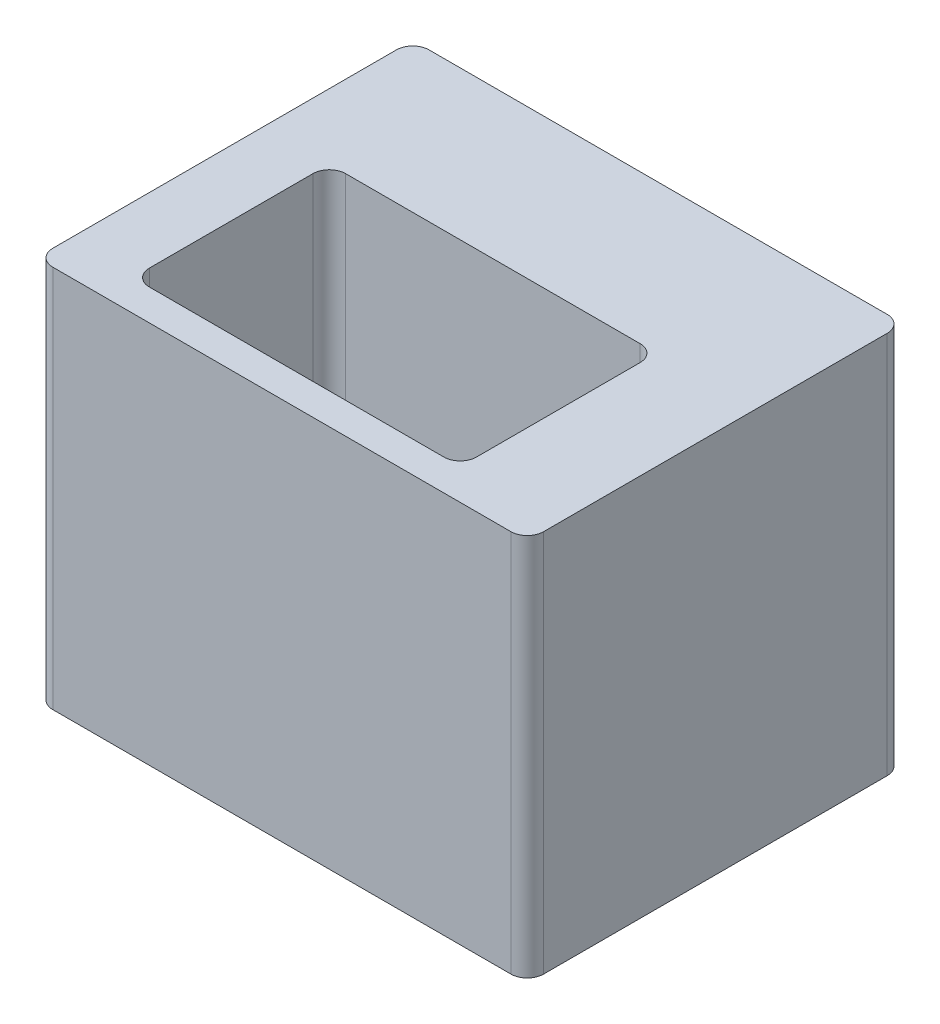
ISO-10303-21;
HEADER;
FILE_DESCRIPTION(('STEP AP214'),'2;1');
FILE_NAME('part.step','',(''),(''),'','','');
FILE_SCHEMA(('AUTOMOTIVE_DESIGN { 1 0 10303 214 1 1 1 1 }'));
ENDSEC;
DATA;
#1=APPLICATION_CONTEXT('core data for automotive mechanical design processes');
#2=APPLICATION_PROTOCOL_DEFINITION('international standard','automotive_design',2000,#1);
#3=PRODUCT_CONTEXT('',#1,'mechanical');
#4=PRODUCT('Part','Part','',(#3));
#5=PRODUCT_RELATED_PRODUCT_CATEGORY('part','',(#4));
#6=PRODUCT_DEFINITION_FORMATION('','',#4);
#7=PRODUCT_DEFINITION_CONTEXT('part definition',#1,'design');
#8=PRODUCT_DEFINITION('design','',#6,#7);
#9=PRODUCT_DEFINITION_SHAPE('','',#8);
#10=(LENGTH_UNIT() NAMED_UNIT(*) SI_UNIT(.MILLI.,.METRE.));
#11=(NAMED_UNIT(*) PLANE_ANGLE_UNIT() SI_UNIT($,.RADIAN.));
#12=(NAMED_UNIT(*) SI_UNIT($,.STERADIAN.) SOLID_ANGLE_UNIT());
#13=UNCERTAINTY_MEASURE_WITH_UNIT(LENGTH_MEASURE(1.E-05),#10,'distance_accuracy_value','');
#14=(GEOMETRIC_REPRESENTATION_CONTEXT(3) GLOBAL_UNCERTAINTY_ASSIGNED_CONTEXT((#13)) GLOBAL_UNIT_ASSIGNED_CONTEXT((#10,
#11,#12)) REPRESENTATION_CONTEXT('',''));
#15=CARTESIAN_POINT('',(0.,0.,0.));
#16=DIRECTION('',(0.,0.,1.));
#17=DIRECTION('',(1.,0.,0.));
#18=AXIS2_PLACEMENT_3D('',#15,#16,#17);
#19=CARTESIAN_POINT('',(-19.05,29.7434,-14.605));
#20=DIRECTION('',(1.,0.,0.));
#21=DIRECTION('',(0.,0.,-1.));
#22=AXIS2_PLACEMENT_3D('',#19,#20,#21);
#23=PLANE('',#22);
#24=DIRECTION('',(0.,0.,1.));
#25=VECTOR('',#24,1.);
#26=CARTESIAN_POINT('',(-19.05,29.7434,-14.605));
#27=LINE('',#26,#25);
#28=CARTESIAN_POINT('',(-19.05,29.7434,-13.335));
#29=VERTEX_POINT('',#28);
#30=CARTESIAN_POINT('',(-19.05,29.7434,13.335));
#31=VERTEX_POINT('',#30);
#32=EDGE_CURVE('E166',#29,#31,#27,.T.);
#33=ORIENTED_EDGE('',*,*,#32,.F.);
#34=DIRECTION('',(0.,-1.,0.));
#35=VECTOR('',#34,1.);
#36=CARTESIAN_POINT('',(-19.05,29.7434,-13.335));
#37=LINE('',#36,#35);
#38=CARTESIAN_POINT('',(-19.05,0.,-13.335));
#39=VERTEX_POINT('',#38);
#40=EDGE_CURVE('E151',#29,#39,#37,.T.);
#41=ORIENTED_EDGE('',*,*,#40,.T.);
#42=DIRECTION('',(0.,0.,1.));
#43=VECTOR('',#42,1.);
#44=CARTESIAN_POINT('',(-19.05,0.,-14.605));
#45=LINE('',#44,#43);
#46=CARTESIAN_POINT('',(-19.05,0.,13.335));
#47=VERTEX_POINT('',#46);
#48=EDGE_CURVE('E163',#39,#47,#45,.T.);
#49=ORIENTED_EDGE('',*,*,#48,.T.);
#50=DIRECTION('',(0.,-1.,0.));
#51=VECTOR('',#50,1.);
#52=CARTESIAN_POINT('',(-19.05,29.7434,13.335));
#53=LINE('',#52,#51);
#54=EDGE_CURVE('E168',#47,#31,#53,.F.);
#55=ORIENTED_EDGE('',*,*,#54,.T.);
#56=EDGE_LOOP('',(#33,#41,#49,#55));
#57=FACE_BOUND('',#56,.T.);
#58=ADVANCED_FACE('F33',(#57),#23,.F.);
#59=CARTESIAN_POINT('',(-19.05,29.7434,14.605));
#60=DIRECTION('',(0.,0.,-1.));
#61=DIRECTION('',(-1.,0.,0.));
#62=AXIS2_PLACEMENT_3D('',#59,#60,#61);
#63=PLANE('',#62);
#64=DIRECTION('',(1.,0.,0.));
#65=VECTOR('',#64,1.);
#66=CARTESIAN_POINT('',(-19.05,0.,14.605));
#67=LINE('',#66,#65);
#68=CARTESIAN_POINT('',(-17.78,0.,14.605));
#69=VERTEX_POINT('',#68);
#70=CARTESIAN_POINT('',(17.78,0.,14.605));
#71=VERTEX_POINT('',#70);
#72=EDGE_CURVE('E172',#69,#71,#67,.T.);
#73=ORIENTED_EDGE('',*,*,#72,.T.);
#74=DIRECTION('',(0.,-1.,0.));
#75=VECTOR('',#74,1.);
#76=CARTESIAN_POINT('',(17.78,29.7434,14.605));
#77=LINE('',#76,#75);
#78=CARTESIAN_POINT('',(17.78,29.7434,14.605));
#79=VERTEX_POINT('',#78);
#80=EDGE_CURVE('E212',#71,#79,#77,.F.);
#81=ORIENTED_EDGE('',*,*,#80,.T.);
#82=DIRECTION('',(1.,0.,0.));
#83=VECTOR('',#82,1.);
#84=CARTESIAN_POINT('',(-19.05,29.7434,14.605));
#85=LINE('',#84,#83);
#86=CARTESIAN_POINT('',(-17.78,29.7434,14.605));
#87=VERTEX_POINT('',#86);
#88=EDGE_CURVE('E284',#87,#79,#85,.T.);
#89=ORIENTED_EDGE('',*,*,#88,.F.);
#90=DIRECTION('',(0.,-1.,0.));
#91=VECTOR('',#90,1.);
#92=CARTESIAN_POINT('',(-17.78,29.7434,14.605));
#93=LINE('',#92,#91);
#94=EDGE_CURVE('E209',#87,#69,#93,.T.);
#95=ORIENTED_EDGE('',*,*,#94,.T.);
#96=EDGE_LOOP('',(#73,#81,#89,#95));
#97=FACE_BOUND('',#96,.T.);
#98=ADVANCED_FACE('F307',(#97),#63,.F.);
#99=CARTESIAN_POINT('',(19.05,29.7434,-14.605));
#100=DIRECTION('',(-1.,0.,0.));
#101=DIRECTION('',(0.,0.,1.));
#102=AXIS2_PLACEMENT_3D('',#99,#100,#101);
#103=PLANE('',#102);
#104=DIRECTION('',(0.,0.,-1.));
#105=VECTOR('',#104,1.);
#106=CARTESIAN_POINT('',(19.05,0.,-14.605));
#107=LINE('',#106,#105);
#108=CARTESIAN_POINT('',(19.05,0.,13.335));
#109=VERTEX_POINT('',#108);
#110=CARTESIAN_POINT('',(19.05,0.,-13.335));
#111=VERTEX_POINT('',#110);
#112=EDGE_CURVE('E176',#109,#111,#107,.T.);
#113=ORIENTED_EDGE('',*,*,#112,.T.);
#114=DIRECTION('',(0.,-1.,0.));
#115=VECTOR('',#114,1.);
#116=CARTESIAN_POINT('',(19.05,29.7434,-13.335));
#117=LINE('',#116,#115);
#118=CARTESIAN_POINT('',(19.05,29.7434,-13.335));
#119=VERTEX_POINT('',#118);
#120=EDGE_CURVE('E207',#111,#119,#117,.F.);
#121=ORIENTED_EDGE('',*,*,#120,.T.);
#122=DIRECTION('',(0.,0.,-1.));
#123=VECTOR('',#122,1.);
#124=CARTESIAN_POINT('',(19.05,29.7434,-14.605));
#125=LINE('',#124,#123);
#126=CARTESIAN_POINT('',(19.05,29.7434,13.335));
#127=VERTEX_POINT('',#126);
#128=EDGE_CURVE('E286',#127,#119,#125,.T.);
#129=ORIENTED_EDGE('',*,*,#128,.F.);
#130=DIRECTION('',(0.,-1.,0.));
#131=VECTOR('',#130,1.);
#132=CARTESIAN_POINT('',(19.05,29.7434,13.335));
#133=LINE('',#132,#131);
#134=EDGE_CURVE('E204',#127,#109,#133,.T.);
#135=ORIENTED_EDGE('',*,*,#134,.T.);
#136=EDGE_LOOP('',(#113,#121,#129,#135));
#137=FACE_BOUND('',#136,.T.);
#138=ADVANCED_FACE('F300',(#137),#103,.F.);
#139=CARTESIAN_POINT('',(-19.05,29.7434,-14.605));
#140=DIRECTION('',(0.,0.,1.));
#141=DIRECTION('',(1.,0.,0.));
#142=AXIS2_PLACEMENT_3D('',#139,#140,#141);
#143=PLANE('',#142);
#144=DIRECTION('',(-1.,0.,0.));
#145=VECTOR('',#144,1.);
#146=CARTESIAN_POINT('',(-19.05,0.,-14.605));
#147=LINE('',#146,#145);
#148=CARTESIAN_POINT('',(17.78,0.,-14.605));
#149=VERTEX_POINT('',#148);
#150=CARTESIAN_POINT('',(-17.78,0.,-14.605));
#151=VERTEX_POINT('',#150);
#152=EDGE_CURVE('E186',#149,#151,#147,.T.);
#153=ORIENTED_EDGE('',*,*,#152,.T.);
#154=DIRECTION('',(0.,-1.,0.));
#155=VECTOR('',#154,1.);
#156=CARTESIAN_POINT('',(-17.78,29.7434,-14.605));
#157=LINE('',#156,#155);
#158=CARTESIAN_POINT('',(-17.78,29.7434,-14.605));
#159=VERTEX_POINT('',#158);
#160=EDGE_CURVE('E152',#151,#159,#157,.F.);
#161=ORIENTED_EDGE('',*,*,#160,.T.);
#162=DIRECTION('',(-1.,0.,0.));
#163=VECTOR('',#162,1.);
#164=CARTESIAN_POINT('',(-19.05,29.7434,-14.605));
#165=LINE('',#164,#163);
#166=CARTESIAN_POINT('',(17.78,29.7434,-14.605));
#167=VERTEX_POINT('',#166);
#168=EDGE_CURVE('E181',#167,#159,#165,.T.);
#169=ORIENTED_EDGE('',*,*,#168,.F.);
#170=DIRECTION('',(0.,-1.,0.));
#171=VECTOR('',#170,1.);
#172=CARTESIAN_POINT('',(17.78,29.7434,-14.605));
#173=LINE('',#172,#171);
#174=EDGE_CURVE('E157',#167,#149,#173,.T.);
#175=ORIENTED_EDGE('',*,*,#174,.T.);
#176=EDGE_LOOP('',(#153,#161,#169,#175));
#177=FACE_BOUND('',#176,.T.);
#178=ADVANCED_FACE('F294',(#177),#143,.F.);
#179=CARTESIAN_POINT('',(0.,29.7434,0.));
#180=DIRECTION('',(0.,1.,0.));
#181=DIRECTION('',(0.,0.,1.));
#182=AXIS2_PLACEMENT_3D('',#179,#180,#181);
#183=PLANE('',#182);
#184=DIRECTION('',(0.,0.,1.));
#185=VECTOR('',#184,1.);
#186=CARTESIAN_POINT('',(-13.97,29.7434,-3.048));
#187=LINE('',#186,#185);
#188=CARTESIAN_POINT('',(-13.97,29.7434,-1.778));
#189=VERTEX_POINT('',#188);
#190=CARTESIAN_POINT('',(-13.97,29.7434,10.922));
#191=VERTEX_POINT('',#190);
#192=EDGE_CURVE('E273',#189,#191,#187,.T.);
#193=ORIENTED_EDGE('',*,*,#192,.F.);
#194=CARTESIAN_POINT('',(-12.7,29.7434,-1.778));
#195=DIRECTION('',(0.,1.,0.));
#196=DIRECTION('',(0.,0.,1.));
#197=AXIS2_PLACEMENT_3D('',#194,#195,#196);
#198=CIRCLE('',#197,1.27);
#199=CARTESIAN_POINT('',(-12.7,29.7434,-3.048));
#200=VERTEX_POINT('',#199);
#201=EDGE_CURVE('E11',#189,#200,#198,.F.);
#202=ORIENTED_EDGE('',*,*,#201,.T.);
#203=DIRECTION('',(-1.,0.,0.));
#204=VECTOR('',#203,1.);
#205=CARTESIAN_POINT('',(-13.97,29.7434,-3.048));
#206=LINE('',#205,#204);
#207=CARTESIAN_POINT('',(10.16,29.7434,-3.048));
#208=VERTEX_POINT('',#207);
#209=EDGE_CURVE('E251',#208,#200,#206,.T.);
#210=ORIENTED_EDGE('',*,*,#209,.F.);
#211=CARTESIAN_POINT('',(10.16,29.7434,-1.778));
#212=DIRECTION('',(0.,1.,0.));
#213=DIRECTION('',(0.,0.,1.));
#214=AXIS2_PLACEMENT_3D('',#211,#212,#213);
#215=CIRCLE('',#214,1.27);
#216=CARTESIAN_POINT('',(11.43,29.7434,-1.778));
#217=VERTEX_POINT('',#216);
#218=EDGE_CURVE('E41',#208,#217,#215,.F.);
#219=ORIENTED_EDGE('',*,*,#218,.T.);
#220=DIRECTION('',(0.,0.,-1.));
#221=VECTOR('',#220,1.);
#222=CARTESIAN_POINT('',(11.43,29.7434,-3.048));
#223=LINE('',#222,#221);
#224=CARTESIAN_POINT('',(11.43,29.7434,10.922));
#225=VERTEX_POINT('',#224);
#226=EDGE_CURVE('E250',#225,#217,#223,.T.);
#227=ORIENTED_EDGE('',*,*,#226,.F.);
#228=CARTESIAN_POINT('',(10.16,29.7434,10.922));
#229=DIRECTION('',(0.,1.,0.));
#230=DIRECTION('',(0.,0.,1.));
#231=AXIS2_PLACEMENT_3D('',#228,#229,#230);
#232=CIRCLE('',#231,1.27);
#233=CARTESIAN_POINT('',(10.16,29.7434,12.192));
#234=VERTEX_POINT('',#233);
#235=EDGE_CURVE('E240',#225,#234,#232,.F.);
#236=ORIENTED_EDGE('',*,*,#235,.T.);
#237=DIRECTION('',(1.,0.,0.));
#238=VECTOR('',#237,1.);
#239=CARTESIAN_POINT('',(-13.97,29.7434,12.192));
#240=LINE('',#239,#238);
#241=CARTESIAN_POINT('',(-12.7,29.7434,12.192));
#242=VERTEX_POINT('',#241);
#243=EDGE_CURVE('E259',#242,#234,#240,.T.);
#244=ORIENTED_EDGE('',*,*,#243,.F.);
#245=CARTESIAN_POINT('',(-12.7,29.7434,10.922));
#246=DIRECTION('',(0.,1.,0.));
#247=DIRECTION('',(0.,0.,1.));
#248=AXIS2_PLACEMENT_3D('',#245,#246,#247);
#249=CIRCLE('',#248,1.27);
#250=EDGE_CURVE('E242',#242,#191,#249,.F.);
#251=ORIENTED_EDGE('',*,*,#250,.T.);
#252=EDGE_LOOP('',(#193,#202,#210,#219,#227,#236,#244,#251));
#253=FACE_BOUND('',#252,.T.);
#254=ORIENTED_EDGE('',*,*,#168,.T.);
#255=CARTESIAN_POINT('',(-17.78,29.7434,-13.335));
#256=DIRECTION('',(0.,1.,0.));
#257=DIRECTION('',(0.,0.,1.));
#258=AXIS2_PLACEMENT_3D('',#255,#256,#257);
#259=CIRCLE('',#258,1.27);
#260=EDGE_CURVE('E202',#159,#29,#259,.T.);
#261=ORIENTED_EDGE('',*,*,#260,.T.);
#262=ORIENTED_EDGE('',*,*,#32,.T.);
#263=CARTESIAN_POINT('',(-17.78,29.7434,13.335));
#264=DIRECTION('',(0.,1.,0.));
#265=DIRECTION('',(0.,0.,1.));
#266=AXIS2_PLACEMENT_3D('',#263,#264,#265);
#267=CIRCLE('',#266,1.27);
#268=EDGE_CURVE('E196',#31,#87,#267,.T.);
#269=ORIENTED_EDGE('',*,*,#268,.T.);
#270=ORIENTED_EDGE('',*,*,#88,.T.);
#271=CARTESIAN_POINT('',(17.78,29.7434,13.335));
#272=DIRECTION('',(0.,1.,0.));
#273=DIRECTION('',(0.,0.,1.));
#274=AXIS2_PLACEMENT_3D('',#271,#272,#273);
#275=CIRCLE('',#274,1.27);
#276=EDGE_CURVE('E198',#79,#127,#275,.T.);
#277=ORIENTED_EDGE('',*,*,#276,.T.);
#278=ORIENTED_EDGE('',*,*,#128,.T.);
#279=CARTESIAN_POINT('',(17.78,29.7434,-13.335));
#280=DIRECTION('',(0.,1.,0.));
#281=DIRECTION('',(0.,0.,1.));
#282=AXIS2_PLACEMENT_3D('',#279,#280,#281);
#283=CIRCLE('',#282,1.27);
#284=EDGE_CURVE('E200',#119,#167,#283,.T.);
#285=ORIENTED_EDGE('',*,*,#284,.T.);
#286=EDGE_LOOP('',(#254,#261,#262,#269,#270,#277,#278,#285));
#287=FACE_BOUND('',#286,.T.);
#288=ADVANCED_FACE('F248',(#253,#287),#183,.T.);
#289=CARTESIAN_POINT('',(0.,0.,0.));
#290=DIRECTION('',(0.,1.,0.));
#291=DIRECTION('',(0.,0.,1.));
#292=AXIS2_PLACEMENT_3D('',#289,#290,#291);
#293=PLANE('',#292);
#294=ORIENTED_EDGE('',*,*,#48,.F.);
#295=CARTESIAN_POINT('',(-17.78,0.,-13.335));
#296=DIRECTION('',(0.,1.,0.));
#297=DIRECTION('',(0.,0.,1.));
#298=AXIS2_PLACEMENT_3D('',#295,#296,#297);
#299=CIRCLE('',#298,1.27);
#300=EDGE_CURVE('E147',#39,#151,#299,.F.);
#301=ORIENTED_EDGE('',*,*,#300,.T.);
#302=ORIENTED_EDGE('',*,*,#152,.F.);
#303=CARTESIAN_POINT('',(17.78,0.,-13.335));
#304=DIRECTION('',(0.,1.,0.));
#305=DIRECTION('',(0.,0.,1.));
#306=AXIS2_PLACEMENT_3D('',#303,#304,#305);
#307=CIRCLE('',#306,1.27);
#308=EDGE_CURVE('E158',#149,#111,#307,.F.);
#309=ORIENTED_EDGE('',*,*,#308,.T.);
#310=ORIENTED_EDGE('',*,*,#112,.F.);
#311=CARTESIAN_POINT('',(17.78,0.,13.335));
#312=DIRECTION('',(0.,1.,0.));
#313=DIRECTION('',(0.,0.,1.));
#314=AXIS2_PLACEMENT_3D('',#311,#312,#313);
#315=CIRCLE('',#314,1.27);
#316=EDGE_CURVE('E190',#109,#71,#315,.F.);
#317=ORIENTED_EDGE('',*,*,#316,.T.);
#318=ORIENTED_EDGE('',*,*,#72,.F.);
#319=CARTESIAN_POINT('',(-17.78,0.,13.335));
#320=DIRECTION('',(0.,1.,0.));
#321=DIRECTION('',(0.,0.,1.));
#322=AXIS2_PLACEMENT_3D('',#319,#320,#321);
#323=CIRCLE('',#322,1.27);
#324=EDGE_CURVE('E167',#69,#47,#323,.F.);
#325=ORIENTED_EDGE('',*,*,#324,.T.);
#326=EDGE_LOOP('',(#294,#301,#302,#309,#310,#317,#318,#325));
#327=FACE_BOUND('',#326,.T.);
#328=ADVANCED_FACE('F170',(#327),#293,.F.);
#329=CARTESIAN_POINT('',(-13.97,13.5382,-3.048));
#330=DIRECTION('',(-1.,0.,0.));
#331=DIRECTION('',(0.,0.,1.));
#332=AXIS2_PLACEMENT_3D('',#329,#330,#331);
#333=PLANE('',#332);
#334=ORIENTED_EDGE('',*,*,#192,.T.);
#335=DIRECTION('',(0.,1.,0.));
#336=VECTOR('',#335,1.);
#337=CARTESIAN_POINT('',(-13.97,13.5382,10.922));
#338=LINE('',#337,#336);
#339=CARTESIAN_POINT('',(-13.97,13.5382,10.922));
#340=VERTEX_POINT('',#339);
#341=EDGE_CURVE('E234',#191,#340,#338,.F.);
#342=ORIENTED_EDGE('',*,*,#341,.T.);
#343=DIRECTION('',(0.,0.,1.));
#344=VECTOR('',#343,1.);
#345=CARTESIAN_POINT('',(-13.97,13.5382,-3.048));
#346=LINE('',#345,#344);
#347=CARTESIAN_POINT('',(-13.97,13.5382,-1.778));
#348=VERTEX_POINT('',#347);
#349=EDGE_CURVE('E275',#348,#340,#346,.T.);
#350=ORIENTED_EDGE('',*,*,#349,.F.);
#351=DIRECTION('',(0.,1.,0.));
#352=VECTOR('',#351,1.);
#353=CARTESIAN_POINT('',(-13.97,29.7434,-1.778));
#354=LINE('',#353,#352);
#355=EDGE_CURVE('E231',#348,#189,#354,.T.);
#356=ORIENTED_EDGE('',*,*,#355,.T.);
#357=EDGE_LOOP('',(#334,#342,#350,#356));
#358=FACE_BOUND('',#357,.T.);
#359=ADVANCED_FACE('F272',(#358),#333,.F.);
#360=CARTESIAN_POINT('',(-13.97,13.5382,-3.048));
#361=DIRECTION('',(0.,0.,-1.));
#362=DIRECTION('',(-1.,0.,0.));
#363=AXIS2_PLACEMENT_3D('',#360,#361,#362);
#364=PLANE('',#363);
#365=DIRECTION('',(-1.,0.,0.));
#366=VECTOR('',#365,1.);
#367=CARTESIAN_POINT('',(-13.97,13.5382,-3.048));
#368=LINE('',#367,#366);
#369=CARTESIAN_POINT('',(10.16,13.5382,-3.048));
#370=VERTEX_POINT('',#369);
#371=CARTESIAN_POINT('',(-12.7,13.5382,-3.048));
#372=VERTEX_POINT('',#371);
#373=EDGE_CURVE('E173',#370,#372,#368,.T.);
#374=ORIENTED_EDGE('',*,*,#373,.F.);
#375=DIRECTION('',(0.,1.,0.));
#376=VECTOR('',#375,1.);
#377=CARTESIAN_POINT('',(10.16,29.7434,-3.048));
#378=LINE('',#377,#376);
#379=EDGE_CURVE('E237',#370,#208,#378,.T.);
#380=ORIENTED_EDGE('',*,*,#379,.T.);
#381=ORIENTED_EDGE('',*,*,#209,.T.);
#382=DIRECTION('',(0.,1.,0.));
#383=VECTOR('',#382,1.);
#384=CARTESIAN_POINT('',(-12.7,13.5382,-3.048));
#385=LINE('',#384,#383);
#386=EDGE_CURVE('E48',#200,#372,#385,.F.);
#387=ORIENTED_EDGE('',*,*,#386,.T.);
#388=EDGE_LOOP('',(#374,#380,#381,#387));
#389=FACE_BOUND('',#388,.T.);
#390=ADVANCED_FACE('F262',(#389),#364,.F.);
#391=CARTESIAN_POINT('',(11.43,13.5382,-3.048));
#392=DIRECTION('',(1.,0.,0.));
#393=DIRECTION('',(0.,0.,-1.));
#394=AXIS2_PLACEMENT_3D('',#391,#392,#393);
#395=PLANE('',#394);
#396=DIRECTION('',(0.,0.,-1.));
#397=VECTOR('',#396,1.);
#398=CARTESIAN_POINT('',(11.43,13.5382,-3.048));
#399=LINE('',#398,#397);
#400=CARTESIAN_POINT('',(11.43,13.5382,10.922));
#401=VERTEX_POINT('',#400);
#402=CARTESIAN_POINT('',(11.43,13.5382,-1.778));
#403=VERTEX_POINT('',#402);
#404=EDGE_CURVE('E178',#401,#403,#399,.T.);
#405=ORIENTED_EDGE('',*,*,#404,.F.);
#406=DIRECTION('',(0.,1.,0.));
#407=VECTOR('',#406,1.);
#408=CARTESIAN_POINT('',(11.43,29.7434,10.922));
#409=LINE('',#408,#407);
#410=EDGE_CURVE('E216',#401,#225,#409,.T.);
#411=ORIENTED_EDGE('',*,*,#410,.T.);
#412=ORIENTED_EDGE('',*,*,#226,.T.);
#413=DIRECTION('',(0.,1.,0.));
#414=VECTOR('',#413,1.);
#415=CARTESIAN_POINT('',(11.43,13.5382,-1.778));
#416=LINE('',#415,#414);
#417=EDGE_CURVE('E214',#217,#403,#416,.F.);
#418=ORIENTED_EDGE('',*,*,#417,.T.);
#419=EDGE_LOOP('',(#405,#411,#412,#418));
#420=FACE_BOUND('',#419,.T.);
#421=ADVANCED_FACE('F257',(#420),#395,.F.);
#422=CARTESIAN_POINT('',(-13.97,13.5382,12.192));
#423=DIRECTION('',(0.,0.,1.));
#424=DIRECTION('',(1.,0.,0.));
#425=AXIS2_PLACEMENT_3D('',#422,#423,#424);
#426=PLANE('',#425);
#427=ORIENTED_EDGE('',*,*,#243,.T.);
#428=DIRECTION('',(0.,1.,0.));
#429=VECTOR('',#428,1.);
#430=CARTESIAN_POINT('',(10.16,13.5382,12.192));
#431=LINE('',#430,#429);
#432=CARTESIAN_POINT('',(10.16,13.5382,12.192));
#433=VERTEX_POINT('',#432);
#434=EDGE_CURVE('E222',#234,#433,#431,.F.);
#435=ORIENTED_EDGE('',*,*,#434,.T.);
#436=DIRECTION('',(1.,0.,0.));
#437=VECTOR('',#436,1.);
#438=CARTESIAN_POINT('',(-13.97,13.5382,12.192));
#439=LINE('',#438,#437);
#440=CARTESIAN_POINT('',(-12.7,13.5382,12.192));
#441=VERTEX_POINT('',#440);
#442=EDGE_CURVE('E384',#441,#433,#439,.T.);
#443=ORIENTED_EDGE('',*,*,#442,.F.);
#444=DIRECTION('',(0.,1.,0.));
#445=VECTOR('',#444,1.);
#446=CARTESIAN_POINT('',(-12.7,29.7434,12.192));
#447=LINE('',#446,#445);
#448=EDGE_CURVE('E219',#441,#242,#447,.T.);
#449=ORIENTED_EDGE('',*,*,#448,.T.);
#450=EDGE_LOOP('',(#427,#435,#443,#449));
#451=FACE_BOUND('',#450,.T.);
#452=ADVANCED_FACE('F387',(#451),#426,.F.);
#453=CARTESIAN_POINT('',(0.,13.5382,0.));
#454=DIRECTION('',(0.,1.,0.));
#455=DIRECTION('',(0.,0.,1.));
#456=AXIS2_PLACEMENT_3D('',#453,#454,#455);
#457=PLANE('',#456);
#458=ORIENTED_EDGE('',*,*,#442,.T.);
#459=CARTESIAN_POINT('',(10.16,13.5382,10.922));
#460=DIRECTION('',(0.,1.,0.));
#461=DIRECTION('',(0.,0.,1.));
#462=AXIS2_PLACEMENT_3D('',#459,#460,#461);
#463=CIRCLE('',#462,1.27);
#464=EDGE_CURVE('E229',#433,#401,#463,.T.);
#465=ORIENTED_EDGE('',*,*,#464,.T.);
#466=ORIENTED_EDGE('',*,*,#404,.T.);
#467=CARTESIAN_POINT('',(10.16,13.5382,-1.778));
#468=DIRECTION('',(0.,1.,0.));
#469=DIRECTION('',(0.,0.,1.));
#470=AXIS2_PLACEMENT_3D('',#467,#468,#469);
#471=CIRCLE('',#470,1.27);
#472=EDGE_CURVE('E55',#403,#370,#471,.T.);
#473=ORIENTED_EDGE('',*,*,#472,.T.);
#474=ORIENTED_EDGE('',*,*,#373,.T.);
#475=CARTESIAN_POINT('',(-12.7,13.5382,-1.778));
#476=DIRECTION('',(0.,1.,0.));
#477=DIRECTION('',(0.,0.,1.));
#478=AXIS2_PLACEMENT_3D('',#475,#476,#477);
#479=CIRCLE('',#478,1.27);
#480=EDGE_CURVE('E224',#372,#348,#479,.T.);
#481=ORIENTED_EDGE('',*,*,#480,.T.);
#482=ORIENTED_EDGE('',*,*,#349,.T.);
#483=CARTESIAN_POINT('',(-12.7,13.5382,10.922));
#484=DIRECTION('',(0.,1.,0.));
#485=DIRECTION('',(0.,0.,1.));
#486=AXIS2_PLACEMENT_3D('',#483,#484,#485);
#487=CIRCLE('',#486,1.27);
#488=EDGE_CURVE('E227',#340,#441,#487,.T.);
#489=ORIENTED_EDGE('',*,*,#488,.T.);
#490=EDGE_LOOP('',(#458,#465,#466,#473,#474,#481,#482,#489));
#491=FACE_BOUND('',#490,.T.);
#492=ADVANCED_FACE('F265',(#491),#457,.T.);
#493=CARTESIAN_POINT('',(-17.78,29.7434,-13.335));
#494=DIRECTION('',(0.,-1.,0.));
#495=DIRECTION('',(0.,0.,-1.));
#496=AXIS2_PLACEMENT_3D('',#493,#494,#495);
#497=CYLINDRICAL_SURFACE('',#496,1.27);
#498=ORIENTED_EDGE('',*,*,#260,.F.);
#499=ORIENTED_EDGE('',*,*,#160,.F.);
#500=ORIENTED_EDGE('',*,*,#300,.F.);
#501=ORIENTED_EDGE('',*,*,#40,.F.);
#502=EDGE_LOOP('',(#498,#499,#500,#501));
#503=FACE_BOUND('',#502,.T.);
#504=ADVANCED_FACE('F150',(#503),#497,.T.);
#505=CARTESIAN_POINT('',(17.78,29.7434,-13.335));
#506=DIRECTION('',(0.,-1.,0.));
#507=DIRECTION('',(0.,0.,-1.));
#508=AXIS2_PLACEMENT_3D('',#505,#506,#507);
#509=CYLINDRICAL_SURFACE('',#508,1.27);
#510=ORIENTED_EDGE('',*,*,#284,.F.);
#511=ORIENTED_EDGE('',*,*,#120,.F.);
#512=ORIENTED_EDGE('',*,*,#308,.F.);
#513=ORIENTED_EDGE('',*,*,#174,.F.);
#514=EDGE_LOOP('',(#510,#511,#512,#513));
#515=FACE_BOUND('',#514,.T.);
#516=ADVANCED_FACE('F296',(#515),#509,.T.);
#517=CARTESIAN_POINT('',(17.78,29.7434,13.335));
#518=DIRECTION('',(0.,-1.,0.));
#519=DIRECTION('',(0.,0.,-1.));
#520=AXIS2_PLACEMENT_3D('',#517,#518,#519);
#521=CYLINDRICAL_SURFACE('',#520,1.27);
#522=ORIENTED_EDGE('',*,*,#276,.F.);
#523=ORIENTED_EDGE('',*,*,#80,.F.);
#524=ORIENTED_EDGE('',*,*,#316,.F.);
#525=ORIENTED_EDGE('',*,*,#134,.F.);
#526=EDGE_LOOP('',(#522,#523,#524,#525));
#527=FACE_BOUND('',#526,.T.);
#528=ADVANCED_FACE('F304',(#527),#521,.T.);
#529=CARTESIAN_POINT('',(-17.78,29.7434,13.335));
#530=DIRECTION('',(0.,-1.,0.));
#531=DIRECTION('',(0.,0.,-1.));
#532=AXIS2_PLACEMENT_3D('',#529,#530,#531);
#533=CYLINDRICAL_SURFACE('',#532,1.27);
#534=ORIENTED_EDGE('',*,*,#268,.F.);
#535=ORIENTED_EDGE('',*,*,#54,.F.);
#536=ORIENTED_EDGE('',*,*,#324,.F.);
#537=ORIENTED_EDGE('',*,*,#94,.F.);
#538=EDGE_LOOP('',(#534,#535,#536,#537));
#539=FACE_BOUND('',#538,.T.);
#540=ADVANCED_FACE('F312',(#539),#533,.T.);
#541=CARTESIAN_POINT('',(10.16,13.5382,10.922));
#542=DIRECTION('',(0.,-1.,0.));
#543=DIRECTION('',(0.,0.,-1.));
#544=AXIS2_PLACEMENT_3D('',#541,#542,#543);
#545=CYLINDRICAL_SURFACE('',#544,1.27);
#546=ORIENTED_EDGE('',*,*,#464,.F.);
#547=ORIENTED_EDGE('',*,*,#434,.F.);
#548=ORIENTED_EDGE('',*,*,#235,.F.);
#549=ORIENTED_EDGE('',*,*,#410,.F.);
#550=EDGE_LOOP('',(#546,#547,#548,#549));
#551=FACE_BOUND('',#550,.T.);
#552=ADVANCED_FACE('F314',(#551),#545,.F.);
#553=CARTESIAN_POINT('',(-12.7,13.5382,10.922));
#554=DIRECTION('',(0.,-1.,0.));
#555=DIRECTION('',(0.,0.,-1.));
#556=AXIS2_PLACEMENT_3D('',#553,#554,#555);
#557=CYLINDRICAL_SURFACE('',#556,1.27);
#558=ORIENTED_EDGE('',*,*,#488,.F.);
#559=ORIENTED_EDGE('',*,*,#341,.F.);
#560=ORIENTED_EDGE('',*,*,#250,.F.);
#561=ORIENTED_EDGE('',*,*,#448,.F.);
#562=EDGE_LOOP('',(#558,#559,#560,#561));
#563=FACE_BOUND('',#562,.T.);
#564=ADVANCED_FACE('F320',(#563),#557,.F.);
#565=CARTESIAN_POINT('',(10.16,13.5382,-1.778));
#566=DIRECTION('',(0.,-1.,0.));
#567=DIRECTION('',(0.,0.,-1.));
#568=AXIS2_PLACEMENT_3D('',#565,#566,#567);
#569=CYLINDRICAL_SURFACE('',#568,1.27);
#570=ORIENTED_EDGE('',*,*,#472,.F.);
#571=ORIENTED_EDGE('',*,*,#417,.F.);
#572=ORIENTED_EDGE('',*,*,#218,.F.);
#573=ORIENTED_EDGE('',*,*,#379,.F.);
#574=EDGE_LOOP('',(#570,#571,#572,#573));
#575=FACE_BOUND('',#574,.T.);
#576=ADVANCED_FACE('F261',(#575),#569,.F.);
#577=CARTESIAN_POINT('',(-12.7,13.5382,-1.778));
#578=DIRECTION('',(0.,-1.,0.));
#579=DIRECTION('',(0.,0.,-1.));
#580=AXIS2_PLACEMENT_3D('',#577,#578,#579);
#581=CYLINDRICAL_SURFACE('',#580,1.27);
#582=ORIENTED_EDGE('',*,*,#480,.F.);
#583=ORIENTED_EDGE('',*,*,#386,.F.);
#584=ORIENTED_EDGE('',*,*,#201,.F.);
#585=ORIENTED_EDGE('',*,*,#355,.F.);
#586=EDGE_LOOP('',(#582,#583,#584,#585));
#587=FACE_BOUND('',#586,.T.);
#588=ADVANCED_FACE('F35',(#587),#581,.F.);
#589=CLOSED_SHELL('',(#58,#98,#138,#178,#288,#328,#359,#390,#421,#452,#492,#504,#516,#528,#540,
#552,#564,#576,#588));
#590=MANIFOLD_SOLID_BREP('B2',#589);
#591=ADVANCED_BREP_SHAPE_REPRESENTATION('',(#18,#590),#14);
#592=SHAPE_DEFINITION_REPRESENTATION(#9,#591);
ENDSEC;
END-ISO-10303-21;
